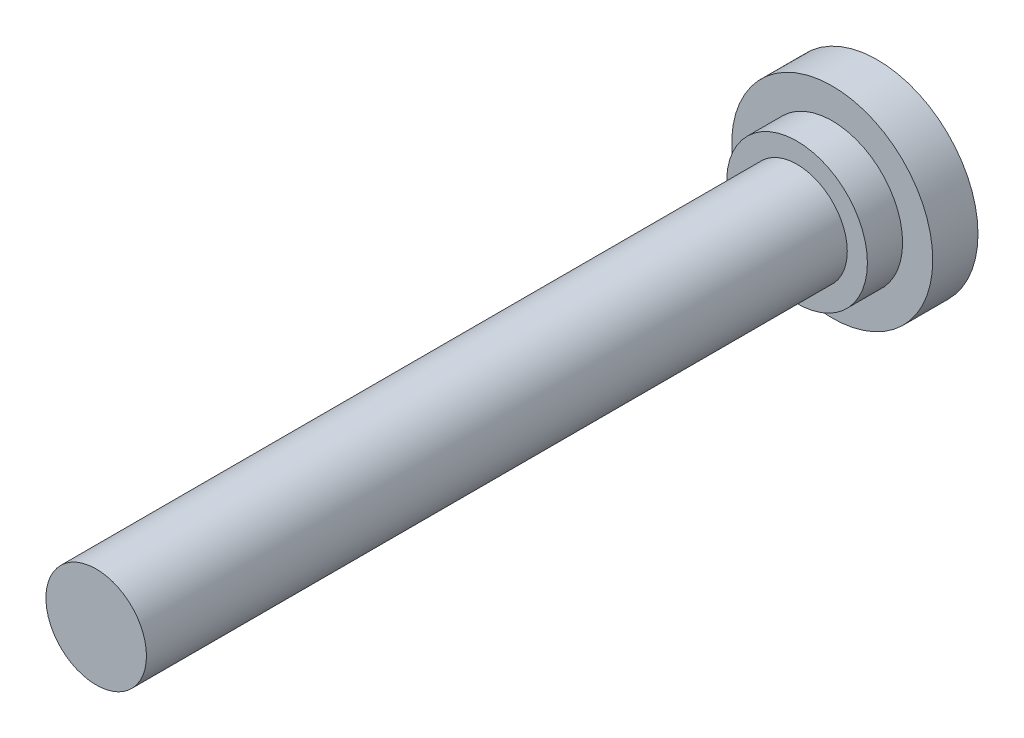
ISO-10303-21;
HEADER;
FILE_DESCRIPTION(('STEP AP214'),'2;1');
FILE_NAME('part.step','',(''),(''),'','','');
FILE_SCHEMA(('AUTOMOTIVE_DESIGN { 1 0 10303 214 1 1 1 1 }'));
ENDSEC;
DATA;
#1=APPLICATION_CONTEXT('core data for automotive mechanical design processes');
#2=APPLICATION_PROTOCOL_DEFINITION('international standard','automotive_design',2000,#1);
#3=PRODUCT_CONTEXT('',#1,'mechanical');
#4=PRODUCT('Part','Part','',(#3));
#5=PRODUCT_RELATED_PRODUCT_CATEGORY('part','',(#4));
#6=PRODUCT_DEFINITION_FORMATION('','',#4);
#7=PRODUCT_DEFINITION_CONTEXT('part definition',#1,'design');
#8=PRODUCT_DEFINITION('design','',#6,#7);
#9=PRODUCT_DEFINITION_SHAPE('','',#8);
#10=(LENGTH_UNIT() NAMED_UNIT(*) SI_UNIT(.MILLI.,.METRE.));
#11=(NAMED_UNIT(*) PLANE_ANGLE_UNIT() SI_UNIT($,.RADIAN.));
#12=(NAMED_UNIT(*) SI_UNIT($,.STERADIAN.) SOLID_ANGLE_UNIT());
#13=UNCERTAINTY_MEASURE_WITH_UNIT(LENGTH_MEASURE(1.E-05),#10,'distance_accuracy_value','');
#14=(GEOMETRIC_REPRESENTATION_CONTEXT(3) GLOBAL_UNCERTAINTY_ASSIGNED_CONTEXT((#13)) GLOBAL_UNIT_ASSIGNED_CONTEXT((#10,
#11,#12)) REPRESENTATION_CONTEXT('',''));
#15=CARTESIAN_POINT('',(0.,0.,0.));
#16=DIRECTION('',(0.,0.,1.));
#17=DIRECTION('',(1.,0.,0.));
#18=AXIS2_PLACEMENT_3D('',#15,#16,#17);
#19=CARTESIAN_POINT('',(0.,0.,155.4));
#20=DIRECTION('',(0.,0.,1.));
#21=DIRECTION('',(1.,0.,0.));
#22=AXIS2_PLACEMENT_3D('',#19,#20,#21);
#23=PLANE('',#22);
#24=CARTESIAN_POINT('',(0.,0.,155.4));
#25=DIRECTION('',(0.,0.,1.));
#26=DIRECTION('',(1.,0.,0.));
#27=AXIS2_PLACEMENT_3D('',#24,#25,#26);
#28=CIRCLE('',#27,10.);
#29=CARTESIAN_POINT('',(10.,0.,155.4));
#30=VERTEX_POINT('',#29);
#31=EDGE_CURVE('E8',#30,#30,#28,.T.);
#32=ORIENTED_EDGE('',*,*,#31,.T.);
#33=EDGE_LOOP('',(#32));
#34=FACE_BOUND('',#33,.T.);
#35=ADVANCED_FACE('F12',(#34),#23,.T.);
#36=CARTESIAN_POINT('',(0.,0.,30.));
#37=DIRECTION('',(0.,0.,1.));
#38=DIRECTION('',(1.,0.,0.));
#39=AXIS2_PLACEMENT_3D('',#36,#37,#38);
#40=CYLINDRICAL_SURFACE('',#39,10.);
#41=CARTESIAN_POINT('',(0.,0.,16.));
#42=DIRECTION('',(0.,0.,1.));
#43=DIRECTION('',(1.,0.,0.));
#44=AXIS2_PLACEMENT_3D('',#41,#42,#43);
#45=CIRCLE('',#44,10.);
#46=CARTESIAN_POINT('',(10.,0.,16.));
#47=VERTEX_POINT('',#46);
#48=EDGE_CURVE('E18',#47,#47,#45,.T.);
#49=ORIENTED_EDGE('',*,*,#48,.T.);
#50=EDGE_LOOP('',(#49));
#51=FACE_BOUND('',#50,.T.);
#52=ORIENTED_EDGE('',*,*,#31,.F.);
#53=EDGE_LOOP('',(#52));
#54=FACE_BOUND('',#53,.T.);
#55=ADVANCED_FACE('F52',(#51,#54),#40,.T.);
#56=CARTESIAN_POINT('',(-10.,0.,16.));
#57=DIRECTION('',(0.,0.,1.));
#58=DIRECTION('',(1.,0.,0.));
#59=AXIS2_PLACEMENT_3D('',#56,#57,#58);
#60=PLANE('',#59);
#61=CARTESIAN_POINT('',(0.,0.,16.));
#62=DIRECTION('',(0.,0.,1.));
#63=DIRECTION('',(1.,0.,0.));
#64=AXIS2_PLACEMENT_3D('',#61,#62,#63);
#65=CIRCLE('',#64,14.);
#66=CARTESIAN_POINT('',(14.,0.,16.));
#67=VERTEX_POINT('',#66);
#68=EDGE_CURVE('E22',#67,#67,#65,.T.);
#69=ORIENTED_EDGE('',*,*,#68,.T.);
#70=EDGE_LOOP('',(#69));
#71=FACE_BOUND('',#70,.T.);
#72=ORIENTED_EDGE('',*,*,#48,.F.);
#73=EDGE_LOOP('',(#72));
#74=FACE_BOUND('',#73,.T.);
#75=ADVANCED_FACE('F57',(#71,#74),#60,.T.);
#76=CARTESIAN_POINT('',(0.,0.,30.));
#77=DIRECTION('',(0.,0.,1.));
#78=DIRECTION('',(1.,0.,0.));
#79=AXIS2_PLACEMENT_3D('',#76,#77,#78);
#80=CYLINDRICAL_SURFACE('',#79,14.);
#81=CARTESIAN_POINT('',(0.,0.,9.));
#82=DIRECTION('',(0.,0.,1.));
#83=DIRECTION('',(1.,0.,0.));
#84=AXIS2_PLACEMENT_3D('',#81,#82,#83);
#85=CIRCLE('',#84,14.);
#86=CARTESIAN_POINT('',(14.,0.,9.));
#87=VERTEX_POINT('',#86);
#88=EDGE_CURVE('E26',#87,#87,#85,.T.);
#89=ORIENTED_EDGE('',*,*,#88,.T.);
#90=EDGE_LOOP('',(#89));
#91=FACE_BOUND('',#90,.T.);
#92=ORIENTED_EDGE('',*,*,#68,.F.);
#93=EDGE_LOOP('',(#92));
#94=FACE_BOUND('',#93,.T.);
#95=ADVANCED_FACE('F62',(#91,#94),#80,.T.);
#96=CARTESIAN_POINT('',(-14.,0.,9.));
#97=DIRECTION('',(0.,0.,1.));
#98=DIRECTION('',(1.,0.,0.));
#99=AXIS2_PLACEMENT_3D('',#96,#97,#98);
#100=PLANE('',#99);
#101=CARTESIAN_POINT('',(0.,0.,9.));
#102=DIRECTION('',(0.,0.,1.));
#103=DIRECTION('',(1.,0.,0.));
#104=AXIS2_PLACEMENT_3D('',#101,#102,#103);
#105=CIRCLE('',#104,20.);
#106=CARTESIAN_POINT('',(20.,0.,9.));
#107=VERTEX_POINT('',#106);
#108=EDGE_CURVE('E31',#107,#107,#105,.T.);
#109=ORIENTED_EDGE('',*,*,#108,.T.);
#110=EDGE_LOOP('',(#109));
#111=FACE_BOUND('',#110,.T.);
#112=ORIENTED_EDGE('',*,*,#88,.F.);
#113=EDGE_LOOP('',(#112));
#114=FACE_BOUND('',#113,.T.);
#115=ADVANCED_FACE('F49',(#111,#114),#100,.T.);
#116=CARTESIAN_POINT('',(0.,0.,30.));
#117=DIRECTION('',(0.,0.,1.));
#118=DIRECTION('',(1.,0.,0.));
#119=AXIS2_PLACEMENT_3D('',#116,#117,#118);
#120=CYLINDRICAL_SURFACE('',#119,20.);
#121=CARTESIAN_POINT('',(0.,0.,0.));
#122=DIRECTION('',(0.,0.,1.));
#123=DIRECTION('',(1.,0.,0.));
#124=AXIS2_PLACEMENT_3D('',#121,#122,#123);
#125=CIRCLE('',#124,20.);
#126=CARTESIAN_POINT('',(20.,0.,0.));
#127=VERTEX_POINT('',#126);
#128=EDGE_CURVE('E34',#127,#127,#125,.T.);
#129=ORIENTED_EDGE('',*,*,#128,.T.);
#130=EDGE_LOOP('',(#129));
#131=FACE_BOUND('',#130,.T.);
#132=ORIENTED_EDGE('',*,*,#108,.F.);
#133=EDGE_LOOP('',(#132));
#134=FACE_BOUND('',#133,.T.);
#135=ADVANCED_FACE('F38',(#131,#134),#120,.T.);
#136=CARTESIAN_POINT('',(-20.,0.,0.));
#137=DIRECTION('',(0.,0.,-1.));
#138=DIRECTION('',(-1.,0.,0.));
#139=AXIS2_PLACEMENT_3D('',#136,#137,#138);
#140=PLANE('',#139);
#141=ORIENTED_EDGE('',*,*,#128,.F.);
#142=EDGE_LOOP('',(#141));
#143=FACE_BOUND('',#142,.T.);
#144=ADVANCED_FACE('F41',(#143),#140,.T.);
#145=CLOSED_SHELL('',(#35,#55,#75,#95,#115,#135,#144));
#146=MANIFOLD_SOLID_BREP('B1',#145);
#147=ADVANCED_BREP_SHAPE_REPRESENTATION('',(#18,#146),#14);
#148=SHAPE_DEFINITION_REPRESENTATION(#9,#147);
ENDSEC;
END-ISO-10303-21;
